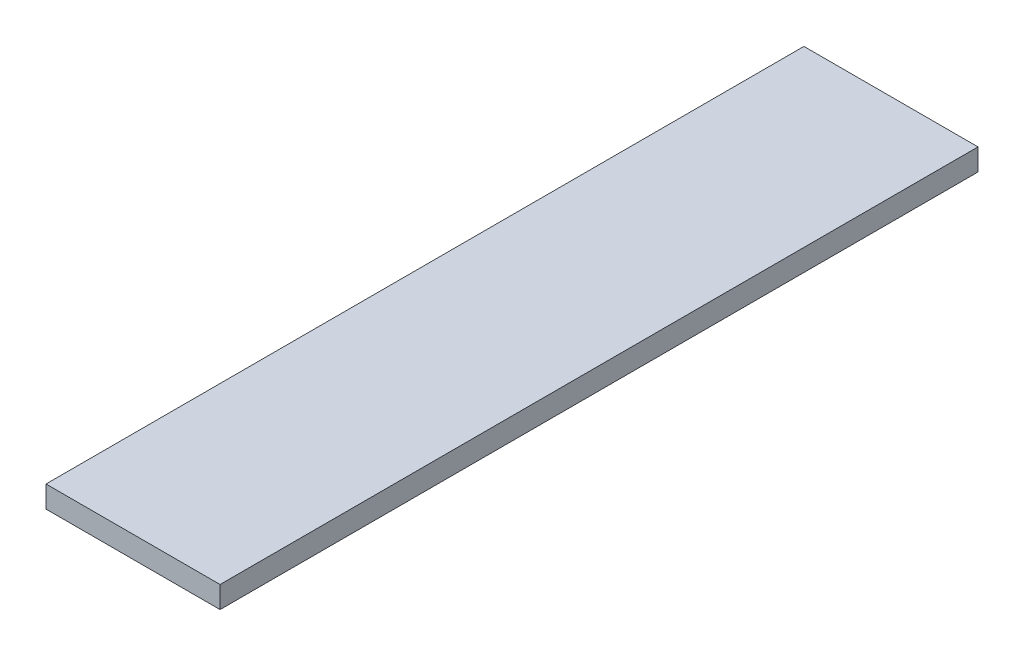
from build123d import *

# Parameters (mm, degrees)
SKETCH1_W           = 76.2
SKETCH1_H           = 331.7875
BOSS_EXTRUDE1_DEPTH = 9.525


with BuildPart() as part:
    # Sketch1 → Boss-Extrude1 (new body)
    with BuildSketch(Plane(origin=(0, 0, 0), x_dir=(1, 0, 0), z_dir=(0, 1, 0))):
        Rectangle(SKETCH1_W, SKETCH1_H)
    extrude(amount=BOSS_EXTRUDE1_DEPTH)


solid = part.part
